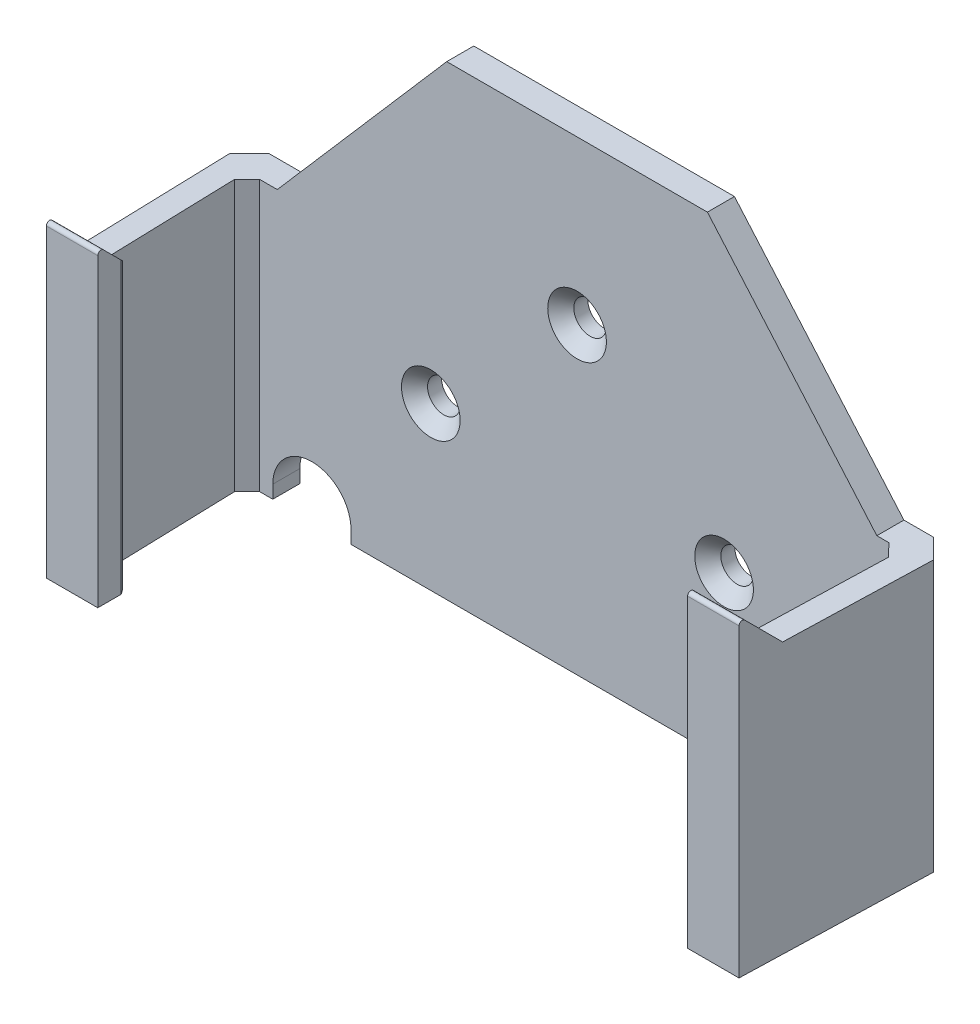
ISO-10303-21;
HEADER;
FILE_DESCRIPTION(('STEP AP214'),'2;1');
FILE_NAME('part.step','',(''),(''),'','','');
FILE_SCHEMA(('AUTOMOTIVE_DESIGN { 1 0 10303 214 1 1 1 1 }'));
ENDSEC;
DATA;
#1=APPLICATION_CONTEXT('core data for automotive mechanical design processes');
#2=APPLICATION_PROTOCOL_DEFINITION('international standard','automotive_design',2000,#1);
#3=PRODUCT_CONTEXT('',#1,'mechanical');
#4=PRODUCT('Part','Part','',(#3));
#5=PRODUCT_RELATED_PRODUCT_CATEGORY('part','',(#4));
#6=PRODUCT_DEFINITION_FORMATION('','',#4);
#7=PRODUCT_DEFINITION_CONTEXT('part definition',#1,'design');
#8=PRODUCT_DEFINITION('design','',#6,#7);
#9=PRODUCT_DEFINITION_SHAPE('','',#8);
#10=(LENGTH_UNIT() NAMED_UNIT(*) SI_UNIT(.MILLI.,.METRE.));
#11=(NAMED_UNIT(*) PLANE_ANGLE_UNIT() SI_UNIT($,.RADIAN.));
#12=(NAMED_UNIT(*) SI_UNIT($,.STERADIAN.) SOLID_ANGLE_UNIT());
#13=UNCERTAINTY_MEASURE_WITH_UNIT(LENGTH_MEASURE(1.E-05),#10,'distance_accuracy_value','');
#14=(GEOMETRIC_REPRESENTATION_CONTEXT(3) GLOBAL_UNCERTAINTY_ASSIGNED_CONTEXT((#13)) GLOBAL_UNIT_ASSIGNED_CONTEXT((#10,
#11,#12)) REPRESENTATION_CONTEXT('',''));
#15=CARTESIAN_POINT('',(0.,0.,0.));
#16=DIRECTION('',(0.,0.,1.));
#17=DIRECTION('',(1.,0.,0.));
#18=AXIS2_PLACEMENT_3D('',#15,#16,#17);
#19=CARTESIAN_POINT('',(116.,41.5,25.5));
#20=DIRECTION('',(0.,-1.,0.));
#21=DIRECTION('',(0.,0.,-1.));
#22=AXIS2_PLACEMENT_3D('',#19,#20,#21);
#23=PLANE('',#22);
#24=DIRECTION('',(-1.,0.,0.));
#25=VECTOR('',#24,1.);
#26=CARTESIAN_POINT('',(116.,41.5,0.));
#27=LINE('',#26,#25);
#28=CARTESIAN_POINT('',(105.,41.5,0.));
#29=VERTEX_POINT('',#28);
#30=CARTESIAN_POINT('',(100.440578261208,41.5,0.));
#31=VERTEX_POINT('',#30);
#32=EDGE_CURVE('E308',#29,#31,#27,.T.);
#33=ORIENTED_EDGE('',*,*,#32,.T.);
#34=DIRECTION('',(0.,0.,-1.));
#35=VECTOR('',#34,1.);
#36=CARTESIAN_POINT('',(100.440578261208,41.5,100.917662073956));
#37=LINE('',#36,#35);
#38=CARTESIAN_POINT('',(100.440578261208,41.5,4.14989884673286));
#39=VERTEX_POINT('',#38);
#40=EDGE_CURVE('E601',#39,#31,#37,.T.);
#41=ORIENTED_EDGE('',*,*,#40,.F.);
#42=DIRECTION('',(-1.,0.,0.));
#43=VECTOR('',#42,1.);
#44=CARTESIAN_POINT('',(104.25,41.5,4.14989884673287));
#45=LINE('',#44,#43);
#46=CARTESIAN_POINT('',(102.30687413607,41.5,4.14989884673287));
#47=VERTEX_POINT('',#46);
#48=EDGE_CURVE('E323',#47,#39,#45,.T.);
#49=ORIENTED_EDGE('',*,*,#48,.F.);
#50=DIRECTION('',(0.685785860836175,0.,0.727803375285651));
#51=VECTOR('',#50,1.);
#52=CARTESIAN_POINT('',(119.402986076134,41.5,22.2934749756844));
#53=LINE('',#52,#51);
#54=CARTESIAN_POINT('',(104.190578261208,41.5,6.14901591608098));
#55=VERTEX_POINT('',#54);
#56=EDGE_CURVE('E491',#47,#55,#53,.T.);
#57=ORIENTED_EDGE('',*,*,#56,.T.);
#58=DIRECTION('',(-0.0297108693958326,0.,0.999558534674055));
#59=VECTOR('',#58,1.);
#60=CARTESIAN_POINT('',(104.25,41.5,4.14989884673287));
#61=LINE('',#60,#59);
#62=CARTESIAN_POINT('',(103.615389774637,41.5,25.5));
#63=VERTEX_POINT('',#62);
#64=EDGE_CURVE('E320',#55,#63,#61,.T.);
#65=ORIENTED_EDGE('',*,*,#64,.T.);
#66=DIRECTION('',(-1.,0.,0.));
#67=VECTOR('',#66,1.);
#68=CARTESIAN_POINT('',(116.,41.5,25.5));
#69=LINE('',#68,#67);
#70=CARTESIAN_POINT('',(107.331210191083,41.5,25.5));
#71=VERTEX_POINT('',#70);
#72=EDGE_CURVE('E321',#71,#63,#69,.T.);
#73=ORIENTED_EDGE('',*,*,#72,.F.);
#74=DIRECTION('',(0.0297108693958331,0.,-0.999558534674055));
#75=VECTOR('',#74,1.);
#76=CARTESIAN_POINT('',(107.338862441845,41.5,25.2425564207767));
#77=LINE('',#76,#75);
#78=CARTESIAN_POINT('',(108.,41.5,3.));
#79=VERTEX_POINT('',#78);
#80=EDGE_CURVE('E314',#71,#79,#77,.T.);
#81=ORIENTED_EDGE('',*,*,#80,.T.);
#82=DIRECTION('',(-0.707106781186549,0.,-0.707106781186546));
#83=VECTOR('',#82,1.);
#84=CARTESIAN_POINT('',(108.,41.5,2.99999999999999));
#85=LINE('',#84,#83);
#86=EDGE_CURVE('E318',#79,#29,#85,.T.);
#87=ORIENTED_EDGE('',*,*,#86,.T.);
#88=EDGE_LOOP('',(#33,#41,#49,#57,#65,#73,#81,#87));
#89=FACE_BOUND('',#88,.T.);
#90=ADVANCED_FACE('F47',(#89),#23,.F.);
#91=CARTESIAN_POINT('',(0.,0.,32.));
#92=DIRECTION('',(0.,1.,0.));
#93=DIRECTION('',(-1.,0.,0.));
#94=AXIS2_PLACEMENT_3D('',#91,#92,#93);
#95=PLANE('',#94);
#96=DIRECTION('',(1.,0.,0.));
#97=VECTOR('',#96,1.);
#98=CARTESIAN_POINT('',(0.,0.,0.));
#99=LINE('',#98,#97);
#100=CARTESIAN_POINT('',(3.,0.,0.));
#101=VERTEX_POINT('',#100);
#102=CARTESIAN_POINT('',(7.75000000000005,0.,0.));
#103=VERTEX_POINT('',#102);
#104=EDGE_CURVE('E389',#101,#103,#99,.T.);
#105=ORIENTED_EDGE('',*,*,#104,.T.);
#106=DIRECTION('',(0.,0.,-1.));
#107=VECTOR('',#106,1.);
#108=CARTESIAN_POINT('',(7.75000000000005,0.,4.25));
#109=LINE('',#108,#107);
#110=CARTESIAN_POINT('',(7.75000000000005,0.,4.14989884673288));
#111=VERTEX_POINT('',#110);
#112=EDGE_CURVE('E681',#111,#103,#109,.T.);
#113=ORIENTED_EDGE('',*,*,#112,.F.);
#114=DIRECTION('',(-1.,0.,0.));
#115=VECTOR('',#114,1.);
#116=CARTESIAN_POINT('',(0.,0.,4.14989884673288));
#117=LINE('',#116,#115);
#118=CARTESIAN_POINT('',(5.75000000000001,0.,4.14989884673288));
#119=VERTEX_POINT('',#118);
#120=EDGE_CURVE('E367',#111,#119,#117,.T.);
#121=ORIENTED_EDGE('',*,*,#120,.T.);
#122=DIRECTION('',(0.707106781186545,0.,-0.70710678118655));
#123=VECTOR('',#122,1.);
#124=CARTESIAN_POINT('',(-11.0500505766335,0.,20.9499494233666));
#125=LINE('',#124,#123);
#126=CARTESIAN_POINT('',(3.80773195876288,0.,6.09216688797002));
#127=VERTEX_POINT('',#126);
#128=EDGE_CURVE('E496',#119,#127,#125,.F.);
#129=ORIENTED_EDGE('',*,*,#128,.T.);
#130=DIRECTION('',(0.0297108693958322,0.,0.999558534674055));
#131=VECTOR('',#130,1.);
#132=CARTESIAN_POINT('',(4.57377516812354,0.,31.8640491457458));
#133=LINE('',#132,#131);
#134=CARTESIAN_POINT('',(4.44423182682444,0.,27.505841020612));
#135=VERTEX_POINT('',#134);
#136=EDGE_CURVE('E370',#127,#135,#133,.T.);
#137=ORIENTED_EDGE('',*,*,#136,.T.);
#138=CARTESIAN_POINT('',(4.64414353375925,0.,27.4998988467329));
#139=DIRECTION('',(0.,1.,0.));
#140=DIRECTION('',(-1.,0.,0.));
#141=AXIS2_PLACEMENT_3D('',#138,#139,#140);
#142=CIRCLE('',#141,0.2);
#143=CARTESIAN_POINT('',(4.64414353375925,0.,27.6998988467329));
#144=VERTEX_POINT('',#143);
#145=EDGE_CURVE('E480',#135,#144,#142,.T.);
#146=ORIENTED_EDGE('',*,*,#145,.T.);
#147=DIRECTION('',(-1.,0.,0.));
#148=VECTOR('',#147,1.);
#149=CARTESIAN_POINT('',(0.,0.,27.6998988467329));
#150=LINE('',#149,#148);
#151=CARTESIAN_POINT('',(8.25000000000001,0.,27.6998988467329));
#152=VERTEX_POINT('',#151);
#153=EDGE_CURVE('E373',#152,#144,#150,.T.);
#154=ORIENTED_EDGE('',*,*,#153,.F.);
#155=DIRECTION('',(0.567371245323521,0.,0.823462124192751));
#156=VECTOR('',#155,1.);
#157=CARTESIAN_POINT('',(7.60328622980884,0.,26.7612818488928));
#158=LINE('',#157,#156);
#159=CARTESIAN_POINT('',(8.75000000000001,0.,28.4255807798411));
#160=VERTEX_POINT('',#159);
#161=EDGE_CURVE('E376',#152,#160,#158,.T.);
#162=ORIENTED_EDGE('',*,*,#161,.T.);
#163=DIRECTION('',(0.,0.,-1.));
#164=VECTOR('',#163,1.);
#165=CARTESIAN_POINT('',(8.75000000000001,0.,32.));
#166=LINE('',#165,#164);
#167=CARTESIAN_POINT('',(8.75000000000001,0.,32.));
#168=VERTEX_POINT('',#167);
#169=EDGE_CURVE('E352',#168,#160,#166,.T.);
#170=ORIENTED_EDGE('',*,*,#169,.F.);
#171=DIRECTION('',(1.,0.,0.));
#172=VECTOR('',#171,1.);
#173=CARTESIAN_POINT('',(0.,0.,32.));
#174=LINE('',#173,#172);
#175=CARTESIAN_POINT('',(0.861995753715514,0.,32.));
#176=VERTEX_POINT('',#175);
#177=EDGE_CURVE('E385',#176,#168,#174,.T.);
#178=ORIENTED_EDGE('',*,*,#177,.F.);
#179=DIRECTION('',(-0.0297108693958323,0.,-0.999558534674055));
#180=VECTOR('',#179,1.);
#181=CARTESIAN_POINT('',(0.86123483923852,0.,31.9744006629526));
#182=LINE('',#181,#180);
#183=CARTESIAN_POINT('',(0.,0.,3.00000000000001));
#184=VERTEX_POINT('',#183);
#185=EDGE_CURVE('E638',#176,#184,#182,.T.);
#186=ORIENTED_EDGE('',*,*,#185,.T.);
#187=DIRECTION('',(0.707106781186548,0.,-0.707106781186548));
#188=VECTOR('',#187,1.);
#189=CARTESIAN_POINT('',(0.,0.,3.));
#190=LINE('',#189,#188);
#191=EDGE_CURVE('E403',#184,#101,#190,.T.);
#192=ORIENTED_EDGE('',*,*,#191,.T.);
#193=EDGE_LOOP('',(#105,#113,#121,#129,#137,#146,#154,#162,#170,#178,#186,#192));
#194=FACE_BOUND('',#193,.T.);
#195=ADVANCED_FACE('F511',(#194),#95,.F.);
#196=CARTESIAN_POINT('',(88.7500000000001,0.,4.14989884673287));
#197=VERTEX_POINT('',#196);
#198=CARTESIAN_POINT('',(19.7500000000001,0.,4.14989884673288));
#199=VERTEX_POINT('',#198);
#200=EDGE_CURVE('E371',#197,#199,#117,.T.);
#201=ORIENTED_EDGE('',*,*,#200,.T.);
#202=DIRECTION('',(0.,0.,-1.));
#203=VECTOR('',#202,1.);
#204=CARTESIAN_POINT('',(19.7500000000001,0.,4.25));
#205=LINE('',#204,#203);
#206=CARTESIAN_POINT('',(19.7500000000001,0.,0.));
#207=VERTEX_POINT('',#206);
#208=EDGE_CURVE('E683',#199,#207,#205,.T.);
#209=ORIENTED_EDGE('',*,*,#208,.T.);
#210=CARTESIAN_POINT('',(88.7500000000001,0.,0.));
#211=VERTEX_POINT('',#210);
#212=EDGE_CURVE('E392',#207,#211,#99,.T.);
#213=ORIENTED_EDGE('',*,*,#212,.T.);
#214=DIRECTION('',(0.,0.,-1.));
#215=VECTOR('',#214,1.);
#216=CARTESIAN_POINT('',(88.7500000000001,0.,4.25));
#217=LINE('',#216,#215);
#218=EDGE_CURVE('E693',#197,#211,#217,.T.);
#219=ORIENTED_EDGE('',*,*,#218,.F.);
#220=EDGE_LOOP('',(#201,#209,#213,#219));
#221=FACE_BOUND('',#220,.T.);
#222=ADVANCED_FACE('F517',(#221),#95,.F.);
#223=CARTESIAN_POINT('',(0.,0.,32.));
#224=DIRECTION('',(0.,0.,-1.));
#225=DIRECTION('',(-1.,0.,0.));
#226=AXIS2_PLACEMENT_3D('',#223,#224,#225);
#227=PLANE('',#226);
#228=DIRECTION('',(-1.,0.,0.));
#229=VECTOR('',#228,1.);
#230=CARTESIAN_POINT('',(0.,46.7928932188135,32.));
#231=LINE('',#230,#229);
#232=CARTESIAN_POINT('',(8.75000000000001,46.7928932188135,32.));
#233=VERTEX_POINT('',#232);
#234=CARTESIAN_POINT('',(0.861995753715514,46.7928932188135,32.));
#235=VERTEX_POINT('',#234);
#236=EDGE_CURVE('E421',#233,#235,#231,.T.);
#237=ORIENTED_EDGE('',*,*,#236,.T.);
#238=DIRECTION('',(0.,1.,0.));
#239=VECTOR('',#238,1.);
#240=CARTESIAN_POINT('',(0.861995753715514,-8.49999999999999,32.));
#241=LINE('',#240,#239);
#242=EDGE_CURVE('E642',#176,#235,#241,.T.);
#243=ORIENTED_EDGE('',*,*,#242,.F.);
#244=ORIENTED_EDGE('',*,*,#177,.T.);
#245=DIRECTION('',(0.,-1.,0.));
#246=VECTOR('',#245,1.);
#247=CARTESIAN_POINT('',(8.75000000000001,0.,32.));
#248=LINE('',#247,#246);
#249=EDGE_CURVE('E387',#233,#168,#248,.T.);
#250=ORIENTED_EDGE('',*,*,#249,.F.);
#251=EDGE_LOOP('',(#237,#243,#244,#250));
#252=FACE_BOUND('',#251,.T.);
#253=ADVANCED_FACE('F760',(#252),#227,.F.);
#254=DIRECTION('',(-0.0297108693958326,0.,0.999558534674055));
#255=VECTOR('',#254,1.);
#256=CARTESIAN_POINT('',(103.330889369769,0.,35.0714064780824));
#257=LINE('',#256,#255);
#258=CARTESIAN_POINT('',(104.190578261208,0.,6.14901591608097));
#259=VERTEX_POINT('',#258);
#260=CARTESIAN_POINT('',(103.555768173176,0.,27.505841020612));
#261=VERTEX_POINT('',#260);
#262=EDGE_CURVE('E365',#259,#261,#257,.T.);
#263=ORIENTED_EDGE('',*,*,#262,.F.);
#264=DIRECTION('',(-0.685785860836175,0.,-0.727803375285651));
#265=VECTOR('',#264,1.);
#266=CARTESIAN_POINT('',(68.0921876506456,0.,-32.1610922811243));
#267=LINE('',#266,#265);
#268=CARTESIAN_POINT('',(102.30687413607,0.,4.14989884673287));
#269=VERTEX_POINT('',#268);
#270=EDGE_CURVE('E493',#259,#269,#267,.T.);
#271=ORIENTED_EDGE('',*,*,#270,.T.);
#272=CARTESIAN_POINT('',(100.75,0.,4.14989884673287));
#273=VERTEX_POINT('',#272);
#274=EDGE_CURVE('E368',#269,#273,#117,.T.);
#275=ORIENTED_EDGE('',*,*,#274,.T.);
#276=DIRECTION('',(0.,0.,-1.));
#277=VECTOR('',#276,1.);
#278=CARTESIAN_POINT('',(100.75,0.,4.25));
#279=LINE('',#278,#277);
#280=CARTESIAN_POINT('',(100.75,0.,0.));
#281=VERTEX_POINT('',#280);
#282=EDGE_CURVE('E690',#273,#281,#279,.T.);
#283=ORIENTED_EDGE('',*,*,#282,.T.);
#284=CARTESIAN_POINT('',(105.,0.,0.));
#285=VERTEX_POINT('',#284);
#286=EDGE_CURVE('E384',#281,#285,#99,.T.);
#287=ORIENTED_EDGE('',*,*,#286,.T.);
#288=DIRECTION('',(0.707106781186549,0.,0.707106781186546));
#289=VECTOR('',#288,1.);
#290=CARTESIAN_POINT('',(108.,0.,2.99999999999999));
#291=LINE('',#290,#289);
#292=CARTESIAN_POINT('',(108.,0.,3.00000000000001));
#293=VERTEX_POINT('',#292);
#294=EDGE_CURVE('E405',#285,#293,#291,.T.);
#295=ORIENTED_EDGE('',*,*,#294,.T.);
#296=DIRECTION('',(-0.0297108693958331,0.,0.999558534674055));
#297=VECTOR('',#296,1.);
#298=CARTESIAN_POINT('',(107.043429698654,0.,35.1817579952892));
#299=LINE('',#298,#297);
#300=CARTESIAN_POINT('',(107.138004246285,0.,32.));
#301=VERTEX_POINT('',#300);
#302=EDGE_CURVE('E309',#293,#301,#299,.T.);
#303=ORIENTED_EDGE('',*,*,#302,.T.);
#304=CARTESIAN_POINT('',(99.25,0.,32.));
#305=VERTEX_POINT('',#304);
#306=EDGE_CURVE('E388',#305,#301,#174,.T.);
#307=ORIENTED_EDGE('',*,*,#306,.F.);
#308=DIRECTION('',(0.,0.,-1.));
#309=VECTOR('',#308,1.);
#310=CARTESIAN_POINT('',(99.25,0.,32.));
#311=LINE('',#310,#309);
#312=CARTESIAN_POINT('',(99.25,0.,28.425580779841));
#313=VERTEX_POINT('',#312);
#314=EDGE_CURVE('E362',#305,#313,#311,.T.);
#315=ORIENTED_EDGE('',*,*,#314,.T.);
#316=DIRECTION('',(-0.56737124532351,0.,0.823462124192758));
#317=VECTOR('',#316,1.);
#318=CARTESIAN_POINT('',(65.6304197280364,0.,77.2198247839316));
#319=LINE('',#318,#317);
#320=CARTESIAN_POINT('',(99.75,0.,27.6998988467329));
#321=VERTEX_POINT('',#320);
#322=EDGE_CURVE('E379',#321,#313,#319,.T.);
#323=ORIENTED_EDGE('',*,*,#322,.F.);
#324=DIRECTION('',(1.,0.,0.));
#325=VECTOR('',#324,1.);
#326=CARTESIAN_POINT('',(0.,0.,27.6998988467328));
#327=LINE('',#326,#325);
#328=CARTESIAN_POINT('',(103.355856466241,0.,27.6998988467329));
#329=VERTEX_POINT('',#328);
#330=EDGE_CURVE('E381',#321,#329,#327,.T.);
#331=ORIENTED_EDGE('',*,*,#330,.T.);
#332=CARTESIAN_POINT('',(103.355856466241,0.,27.4998988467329));
#333=DIRECTION('',(0.,1.,0.));
#334=DIRECTION('',(-1.,0.,0.));
#335=AXIS2_PLACEMENT_3D('',#332,#333,#334);
#336=CIRCLE('',#335,0.2);
#337=EDGE_CURVE('E475',#329,#261,#336,.T.);
#338=ORIENTED_EDGE('',*,*,#337,.T.);
#339=EDGE_LOOP('',(#263,#271,#275,#283,#287,#295,#303,#307,#315,#323,#331,#338));
#340=FACE_BOUND('',#339,.T.);
#341=ADVANCED_FACE('F520',(#340),#95,.F.);
#342=ORIENTED_EDGE('',*,*,#306,.T.);
#343=DIRECTION('',(0.,1.,0.));
#344=VECTOR('',#343,1.);
#345=CARTESIAN_POINT('',(107.138004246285,-8.49999999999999,32.));
#346=LINE('',#345,#344);
#347=CARTESIAN_POINT('',(107.138004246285,46.7928932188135,32.));
#348=VERTEX_POINT('',#347);
#349=EDGE_CURVE('E680',#301,#348,#346,.T.);
#350=ORIENTED_EDGE('',*,*,#349,.T.);
#351=DIRECTION('',(-1.,0.,0.));
#352=VECTOR('',#351,1.);
#353=CARTESIAN_POINT('',(0.,46.7928932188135,32.));
#354=LINE('',#353,#352);
#355=CARTESIAN_POINT('',(99.25,46.7928932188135,32.));
#356=VERTEX_POINT('',#355);
#357=EDGE_CURVE('E414',#348,#356,#354,.T.);
#358=ORIENTED_EDGE('',*,*,#357,.T.);
#359=DIRECTION('',(0.,-1.,0.));
#360=VECTOR('',#359,1.);
#361=CARTESIAN_POINT('',(99.25,0.,32.));
#362=LINE('',#361,#360);
#363=EDGE_CURVE('E395',#356,#305,#362,.T.);
#364=ORIENTED_EDGE('',*,*,#363,.T.);
#365=EDGE_LOOP('',(#342,#350,#358,#364));
#366=FACE_BOUND('',#365,.T.);
#367=ADVANCED_FACE('F706',(#366),#227,.F.);
#368=CARTESIAN_POINT('',(0.,0.,0.));
#369=DIRECTION('',(0.,0.,-1.));
#370=DIRECTION('',(-1.,0.,0.));
#371=AXIS2_PLACEMENT_3D('',#368,#369,#370);
#372=PLANE('',#371);
#373=CARTESIAN_POINT('',(54.4405782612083,46.5,0.));
#374=DIRECTION('',(0.,0.,-1.));
#375=DIRECTION('',(-1.,0.,0.));
#376=AXIS2_PLACEMENT_3D('',#373,#374,#375);
#377=CIRCLE('',#376,2.5);
#378=CARTESIAN_POINT('',(51.9405782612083,46.5,0.));
#379=VERTEX_POINT('',#378);
#380=EDGE_CURVE('E291',#379,#379,#377,.T.);
#381=ORIENTED_EDGE('',*,*,#380,.F.);
#382=EDGE_LOOP('',(#381));
#383=FACE_BOUND('',#382,.T.);
#384=CARTESIAN_POINT('',(77.,24.8351380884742,0.));
#385=DIRECTION('',(0.,0.,-1.));
#386=DIRECTION('',(-1.,0.,0.));
#387=AXIS2_PLACEMENT_3D('',#384,#385,#386);
#388=CIRCLE('',#387,2.50000000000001);
#389=CARTESIAN_POINT('',(74.5,24.8351380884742,0.));
#390=VERTEX_POINT('',#389);
#391=EDGE_CURVE('E662',#390,#390,#388,.T.);
#392=ORIENTED_EDGE('',*,*,#391,.F.);
#393=EDGE_LOOP('',(#392));
#394=FACE_BOUND('',#393,.T.);
#395=CARTESIAN_POINT('',(32.,24.8351380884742,0.));
#396=DIRECTION('',(0.,0.,-1.));
#397=DIRECTION('',(-1.,0.,0.));
#398=AXIS2_PLACEMENT_3D('',#395,#396,#397);
#399=CIRCLE('',#398,2.49999999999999);
#400=CARTESIAN_POINT('',(29.5,24.8351380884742,0.));
#401=VERTEX_POINT('',#400);
#402=EDGE_CURVE('E661',#401,#401,#399,.T.);
#403=ORIENTED_EDGE('',*,*,#402,.F.);
#404=EDGE_LOOP('',(#403));
#405=FACE_BOUND('',#404,.T.);
#406=DIRECTION('',(0.,1.,0.));
#407=VECTOR('',#406,1.);
#408=CARTESIAN_POINT('',(7.75000000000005,2.,0.));
#409=LINE('',#408,#407);
#410=CARTESIAN_POINT('',(7.75000000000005,2.,0.));
#411=VERTEX_POINT('',#410);
#412=EDGE_CURVE('E674',#103,#411,#409,.T.);
#413=ORIENTED_EDGE('',*,*,#412,.F.);
#414=ORIENTED_EDGE('',*,*,#104,.F.);
#415=DIRECTION('',(0.,1.,0.));
#416=VECTOR('',#415,1.);
#417=CARTESIAN_POINT('',(3.,48.,0.));
#418=LINE('',#417,#416);
#419=CARTESIAN_POINT('',(3.,41.5,0.));
#420=VERTEX_POINT('',#419);
#421=EDGE_CURVE('E307',#101,#420,#418,.T.);
#422=ORIENTED_EDGE('',*,*,#421,.T.);
#423=CARTESIAN_POINT('',(8.44057826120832,41.5,0.));
#424=VERTEX_POINT('',#423);
#425=EDGE_CURVE('E297',#424,#420,#27,.T.);
#426=ORIENTED_EDGE('',*,*,#425,.F.);
#427=DIRECTION('',(0.654930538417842,0.755689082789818,0.));
#428=VECTOR('',#427,1.);
#429=CARTESIAN_POINT('',(34.4405782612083,71.5,0.));
#430=LINE('',#429,#428);
#431=CARTESIAN_POINT('',(34.4405782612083,71.5,0.));
#432=VERTEX_POINT('',#431);
#433=EDGE_CURVE('E282',#424,#432,#430,.T.);
#434=ORIENTED_EDGE('',*,*,#433,.T.);
#435=DIRECTION('',(1.,0.,0.));
#436=VECTOR('',#435,1.);
#437=CARTESIAN_POINT('',(74.4405782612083,71.5,0.));
#438=LINE('',#437,#436);
#439=CARTESIAN_POINT('',(74.4405782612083,71.5,0.));
#440=VERTEX_POINT('',#439);
#441=EDGE_CURVE('E290',#432,#440,#438,.T.);
#442=ORIENTED_EDGE('',*,*,#441,.T.);
#443=DIRECTION('',(0.654930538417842,-0.755689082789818,0.));
#444=VECTOR('',#443,1.);
#445=CARTESIAN_POINT('',(100.440578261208,41.5,0.));
#446=LINE('',#445,#444);
#447=EDGE_CURVE('E300',#440,#31,#446,.T.);
#448=ORIENTED_EDGE('',*,*,#447,.T.);
#449=ORIENTED_EDGE('',*,*,#32,.F.);
#450=DIRECTION('',(0.,-1.,0.));
#451=VECTOR('',#450,1.);
#452=CARTESIAN_POINT('',(105.,0.,0.));
#453=LINE('',#452,#451);
#454=EDGE_CURVE('E400',#29,#285,#453,.T.);
#455=ORIENTED_EDGE('',*,*,#454,.T.);
#456=ORIENTED_EDGE('',*,*,#286,.F.);
#457=DIRECTION('',(0.,-1.,0.));
#458=VECTOR('',#457,1.);
#459=CARTESIAN_POINT('',(100.75,1.99999999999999,0.));
#460=LINE('',#459,#458);
#461=CARTESIAN_POINT('',(100.75,1.99999999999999,0.));
#462=VERTEX_POINT('',#461);
#463=EDGE_CURVE('E698',#462,#281,#460,.T.);
#464=ORIENTED_EDGE('',*,*,#463,.F.);
#465=CARTESIAN_POINT('',(94.7500000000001,2.,0.));
#466=DIRECTION('',(0.,0.,-1.));
#467=DIRECTION('',(-1.,0.,0.));
#468=AXIS2_PLACEMENT_3D('',#465,#466,#467);
#469=CIRCLE('',#468,5.99999999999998);
#470=CARTESIAN_POINT('',(88.7500000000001,2.,0.));
#471=VERTEX_POINT('',#470);
#472=EDGE_CURVE('E672',#471,#462,#469,.T.);
#473=ORIENTED_EDGE('',*,*,#472,.F.);
#474=DIRECTION('',(0.,1.,0.));
#475=VECTOR('',#474,1.);
#476=CARTESIAN_POINT('',(88.7500000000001,2.,0.));
#477=LINE('',#476,#475);
#478=EDGE_CURVE('E689',#211,#471,#477,.T.);
#479=ORIENTED_EDGE('',*,*,#478,.F.);
#480=ORIENTED_EDGE('',*,*,#212,.F.);
#481=DIRECTION('',(0.,-1.,0.));
#482=VECTOR('',#481,1.);
#483=CARTESIAN_POINT('',(19.7500000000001,2.,0.));
#484=LINE('',#483,#482);
#485=CARTESIAN_POINT('',(19.7500000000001,2.,0.));
#486=VERTEX_POINT('',#485);
#487=EDGE_CURVE('E671',#486,#207,#484,.T.);
#488=ORIENTED_EDGE('',*,*,#487,.F.);
#489=CARTESIAN_POINT('',(13.7500000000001,2.,0.));
#490=DIRECTION('',(0.,0.,-1.));
#491=DIRECTION('',(1.,0.,0.));
#492=AXIS2_PLACEMENT_3D('',#489,#490,#491);
#493=CIRCLE('',#492,6.00000000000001);
#494=EDGE_CURVE('E668',#411,#486,#493,.T.);
#495=ORIENTED_EDGE('',*,*,#494,.F.);
#496=EDGE_LOOP('',(#413,#414,#422,#426,#434,#442,#448,#449,#455,#456,#464,#473,#479,#480,#488,#495));
#497=FACE_BOUND('',#496,.T.);
#498=ADVANCED_FACE('F304',(#383,#394,#405,#497),#372,.T.);
#499=CARTESIAN_POINT('',(99.75,-71.,27.6998988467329));
#500=DIRECTION('',(0.,0.,1.));
#501=DIRECTION('',(1.,0.,0.));
#502=AXIS2_PLACEMENT_3D('',#499,#500,#501);
#503=PLANE('',#502);
#504=DIRECTION('',(1.,0.,0.));
#505=VECTOR('',#504,1.);
#506=CARTESIAN_POINT('',(99.7499999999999,43.6998988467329,27.6998988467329));
#507=LINE('',#506,#505);
#508=CARTESIAN_POINT('',(99.75,43.6998988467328,27.6998988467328));
#509=VERTEX_POINT('',#508);
#510=CARTESIAN_POINT('',(103.355856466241,43.6998988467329,27.6998988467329));
#511=VERTEX_POINT('',#510);
#512=EDGE_CURVE('E342',#509,#511,#507,.T.);
#513=ORIENTED_EDGE('',*,*,#512,.T.);
#514=DIRECTION('',(0.,1.,0.));
#515=VECTOR('',#514,1.);
#516=CARTESIAN_POINT('',(103.355856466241,-71.,27.6998988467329));
#517=LINE('',#516,#515);
#518=EDGE_CURVE('E465',#511,#329,#517,.F.);
#519=ORIENTED_EDGE('',*,*,#518,.T.);
#520=ORIENTED_EDGE('',*,*,#330,.F.);
#521=DIRECTION('',(0.,1.,0.));
#522=VECTOR('',#521,1.);
#523=CARTESIAN_POINT('',(99.75,-71.,27.6998988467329));
#524=LINE('',#523,#522);
#525=EDGE_CURVE('E349',#321,#509,#524,.T.);
#526=ORIENTED_EDGE('',*,*,#525,.T.);
#527=EDGE_LOOP('',(#513,#519,#520,#526));
#528=FACE_BOUND('',#527,.T.);
#529=ADVANCED_FACE('F890',(#528),#503,.F.);
#530=CARTESIAN_POINT('',(99.75,-71.,27.6998988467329));
#531=DIRECTION('',(-0.823462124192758,0.,-0.56737124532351));
#532=DIRECTION('',(-0.56737124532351,0.,0.823462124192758));
#533=AXIS2_PLACEMENT_3D('',#530,#531,#532);
#534=PLANE('',#533);
#535=DIRECTION('',(-0.437985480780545,0.635676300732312,0.635676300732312));
#536=VECTOR('',#535,1.);
#537=CARTESIAN_POINT('',(131.684400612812,-2.64853629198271,-18.6485362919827));
#538=LINE('',#537,#536);
#539=CARTESIAN_POINT('',(99.25,44.425580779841,28.425580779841));
#540=VERTEX_POINT('',#539);
#541=EDGE_CURVE('E339',#509,#540,#538,.T.);
#542=ORIENTED_EDGE('',*,*,#541,.F.);
#543=ORIENTED_EDGE('',*,*,#525,.F.);
#544=ORIENTED_EDGE('',*,*,#322,.T.);
#545=DIRECTION('',(0.,1.,0.));
#546=VECTOR('',#545,1.);
#547=CARTESIAN_POINT('',(99.25,-71.,28.425580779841));
#548=LINE('',#547,#546);
#549=EDGE_CURVE('E353',#313,#540,#548,.T.);
#550=ORIENTED_EDGE('',*,*,#549,.T.);
#551=EDGE_LOOP('',(#542,#543,#544,#550));
#552=FACE_BOUND('',#551,.T.);
#553=ADVANCED_FACE('F1163',(#552),#534,.T.);
#554=CARTESIAN_POINT('',(8.25000000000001,-71.,27.6998988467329));
#555=DIRECTION('',(-0.823462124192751,0.,0.567371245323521));
#556=DIRECTION('',(0.567371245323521,0.,0.823462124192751));
#557=AXIS2_PLACEMENT_3D('',#554,#555,#556);
#558=PLANE('',#557);
#559=DIRECTION('',(0.,1.,0.));
#560=VECTOR('',#559,1.);
#561=CARTESIAN_POINT('',(8.25000000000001,-71.,27.6998988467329));
#562=LINE('',#561,#560);
#563=CARTESIAN_POINT('',(8.25000000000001,43.6998988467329,27.6998988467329));
#564=VERTEX_POINT('',#563);
#565=EDGE_CURVE('E348',#152,#564,#562,.T.);
#566=ORIENTED_EDGE('',*,*,#565,.T.);
#567=DIRECTION('',(0.437985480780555,0.635676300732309,0.635676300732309));
#568=VECTOR('',#567,1.);
#569=CARTESIAN_POINT('',(-23.6844006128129,-2.6485362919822,-18.6485362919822));
#570=LINE('',#569,#568);
#571=CARTESIAN_POINT('',(8.75000000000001,44.425580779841,28.4255807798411));
#572=VERTEX_POINT('',#571);
#573=EDGE_CURVE('E328',#564,#572,#570,.T.);
#574=ORIENTED_EDGE('',*,*,#573,.T.);
#575=DIRECTION('',(0.,1.,0.));
#576=VECTOR('',#575,1.);
#577=CARTESIAN_POINT('',(8.75000000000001,-71.,28.4255807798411));
#578=LINE('',#577,#576);
#579=EDGE_CURVE('E356',#160,#572,#578,.T.);
#580=ORIENTED_EDGE('',*,*,#579,.F.);
#581=ORIENTED_EDGE('',*,*,#161,.F.);
#582=EDGE_LOOP('',(#566,#574,#580,#581));
#583=FACE_BOUND('',#582,.T.);
#584=ADVANCED_FACE('F749',(#583),#558,.F.);
#585=CARTESIAN_POINT('',(8.25000000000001,-71.,27.6998988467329));
#586=DIRECTION('',(0.,0.,-1.));
#587=DIRECTION('',(-1.,0.,0.));
#588=AXIS2_PLACEMENT_3D('',#585,#586,#587);
#589=PLANE('',#588);
#590=ORIENTED_EDGE('',*,*,#153,.T.);
#591=DIRECTION('',(0.,1.,0.));
#592=VECTOR('',#591,1.);
#593=CARTESIAN_POINT('',(4.64414353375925,-71.,27.6998988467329));
#594=LINE('',#593,#592);
#595=CARTESIAN_POINT('',(4.64414353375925,43.6998988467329,27.6998988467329));
#596=VERTEX_POINT('',#595);
#597=EDGE_CURVE('E467',#144,#596,#594,.T.);
#598=ORIENTED_EDGE('',*,*,#597,.T.);
#599=DIRECTION('',(-1.,0.,0.));
#600=VECTOR('',#599,1.);
#601=CARTESIAN_POINT('',(8.25000000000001,43.6998988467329,27.6998988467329));
#602=LINE('',#601,#600);
#603=EDGE_CURVE('E331',#564,#596,#602,.T.);
#604=ORIENTED_EDGE('',*,*,#603,.F.);
#605=ORIENTED_EDGE('',*,*,#565,.F.);
#606=EDGE_LOOP('',(#590,#598,#604,#605));
#607=FACE_BOUND('',#606,.T.);
#608=ADVANCED_FACE('F745',(#607),#589,.T.);
#609=CARTESIAN_POINT('',(3.75,-71.,4.14989884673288));
#610=DIRECTION('',(-0.999558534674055,0.,0.0297108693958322));
#611=DIRECTION('',(0.0297108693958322,0.,0.999558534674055));
#612=AXIS2_PLACEMENT_3D('',#609,#610,#611);
#613=PLANE('',#612);
#614=ORIENTED_EDGE('',*,*,#136,.F.);
#615=DIRECTION('',(0.,1.,0.));
#616=VECTOR('',#615,1.);
#617=CARTESIAN_POINT('',(3.80773195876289,41.5,6.09216688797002));
#618=LINE('',#617,#616);
#619=CARTESIAN_POINT('',(3.80773195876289,41.5,6.09216688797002));
#620=VERTEX_POINT('',#619);
#621=EDGE_CURVE('E489',#127,#620,#618,.T.);
#622=ORIENTED_EDGE('',*,*,#621,.T.);
#623=DIRECTION('',(0.0297108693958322,0.,0.999558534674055));
#624=VECTOR('',#623,1.);
#625=CARTESIAN_POINT('',(3.75,41.5,4.14989884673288));
#626=LINE('',#625,#624);
#627=CARTESIAN_POINT('',(4.38461022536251,41.5,25.5));
#628=VERTEX_POINT('',#627);
#629=EDGE_CURVE('E326',#620,#628,#626,.T.);
#630=ORIENTED_EDGE('',*,*,#629,.T.);
#631=DIRECTION('',(0.0210133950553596,0.706950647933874,0.706950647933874));
#632=VECTOR('',#631,1.);
#633=CARTESIAN_POINT('',(2.39592876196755,-25.4049263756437,-41.4049263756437));
#634=LINE('',#633,#632);
#635=CARTESIAN_POINT('',(4.44423182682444,43.505841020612,27.505841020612));
#636=VERTEX_POINT('',#635);
#637=EDGE_CURVE('E334',#628,#636,#634,.T.);
#638=ORIENTED_EDGE('',*,*,#637,.T.);
#639=DIRECTION('',(0.,1.,0.));
#640=VECTOR('',#639,1.);
#641=CARTESIAN_POINT('',(4.44423182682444,-71.,27.505841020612));
#642=LINE('',#641,#640);
#643=EDGE_CURVE('E470',#636,#135,#642,.F.);
#644=ORIENTED_EDGE('',*,*,#643,.T.);
#645=EDGE_LOOP('',(#614,#622,#630,#638,#644));
#646=FACE_BOUND('',#645,.T.);
#647=ADVANCED_FACE('F737',(#646),#613,.F.);
#648=CARTESIAN_POINT('',(104.25,-71.,4.14989884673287));
#649=DIRECTION('',(0.,0.,-1.));
#650=DIRECTION('',(-1.,0.,0.));
#651=AXIS2_PLACEMENT_3D('',#648,#649,#650);
#652=PLANE('',#651);
#653=CARTESIAN_POINT('',(54.4405782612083,46.5,4.14989884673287));
#654=DIRECTION('',(0.,0.,-1.));
#655=DIRECTION('',(-1.,0.,0.));
#656=AXIS2_PLACEMENT_3D('',#653,#654,#655);
#657=CIRCLE('',#656,4.49999999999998);
#658=CARTESIAN_POINT('',(49.9405782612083,46.5,4.14989884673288));
#659=VERTEX_POINT('',#658);
#660=EDGE_CURVE('E11',#659,#659,#657,.T.);
#661=ORIENTED_EDGE('',*,*,#660,.T.);
#662=EDGE_LOOP('',(#661));
#663=FACE_BOUND('',#662,.T.);
#664=CARTESIAN_POINT('',(77.,24.8351380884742,4.14989884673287));
#665=DIRECTION('',(0.,0.,-1.));
#666=DIRECTION('',(-1.,0.,0.));
#667=AXIS2_PLACEMENT_3D('',#664,#665,#666);
#668=CIRCLE('',#667,4.50000000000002);
#669=CARTESIAN_POINT('',(72.5,24.8351380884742,4.14989884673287));
#670=VERTEX_POINT('',#669);
#671=EDGE_CURVE('E453',#670,#670,#668,.T.);
#672=ORIENTED_EDGE('',*,*,#671,.T.);
#673=EDGE_LOOP('',(#672));
#674=FACE_BOUND('',#673,.T.);
#675=CARTESIAN_POINT('',(32.,24.8351380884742,4.14989884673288));
#676=DIRECTION('',(0.,0.,-1.));
#677=DIRECTION('',(-1.,0.,0.));
#678=AXIS2_PLACEMENT_3D('',#675,#676,#677);
#679=CIRCLE('',#678,4.5);
#680=CARTESIAN_POINT('',(27.5,24.8351380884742,4.14989884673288));
#681=VERTEX_POINT('',#680);
#682=EDGE_CURVE('E450',#681,#681,#679,.T.);
#683=ORIENTED_EDGE('',*,*,#682,.T.);
#684=EDGE_LOOP('',(#683));
#685=FACE_BOUND('',#684,.T.);
#686=ORIENTED_EDGE('',*,*,#274,.F.);
#687=DIRECTION('',(0.,1.,0.));
#688=VECTOR('',#687,1.);
#689=CARTESIAN_POINT('',(102.30687413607,-71.,4.14989884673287));
#690=LINE('',#689,#688);
#691=EDGE_CURVE('E484',#269,#47,#690,.T.);
#692=ORIENTED_EDGE('',*,*,#691,.T.);
#693=ORIENTED_EDGE('',*,*,#48,.T.);
#694=DIRECTION('',(-0.654930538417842,0.755689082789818,0.));
#695=VECTOR('',#694,1.);
#696=CARTESIAN_POINT('',(100.440578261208,41.5,4.14989884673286));
#697=LINE('',#696,#695);
#698=CARTESIAN_POINT('',(74.4405782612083,71.5,4.14989884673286));
#699=VERTEX_POINT('',#698);
#700=EDGE_CURVE('E598',#39,#699,#697,.T.);
#701=ORIENTED_EDGE('',*,*,#700,.T.);
#702=DIRECTION('',(-1.,0.,0.));
#703=VECTOR('',#702,1.);
#704=CARTESIAN_POINT('',(74.4405782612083,71.5,4.14989884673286));
#705=LINE('',#704,#703);
#706=CARTESIAN_POINT('',(34.4405782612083,71.5,4.14989884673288));
#707=VERTEX_POINT('',#706);
#708=EDGE_CURVE('E607',#699,#707,#705,.T.);
#709=ORIENTED_EDGE('',*,*,#708,.T.);
#710=DIRECTION('',(-0.654930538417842,-0.755689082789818,0.));
#711=VECTOR('',#710,1.);
#712=CARTESIAN_POINT('',(34.4405782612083,71.5,4.14989884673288));
#713=LINE('',#712,#711);
#714=CARTESIAN_POINT('',(8.44057826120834,41.5,4.14989884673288));
#715=VERTEX_POINT('',#714);
#716=EDGE_CURVE('E606',#707,#715,#713,.T.);
#717=ORIENTED_EDGE('',*,*,#716,.T.);
#718=CARTESIAN_POINT('',(5.75000000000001,41.5,4.14989884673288));
#719=VERTEX_POINT('',#718);
#720=EDGE_CURVE('E299',#715,#719,#45,.T.);
#721=ORIENTED_EDGE('',*,*,#720,.T.);
#722=DIRECTION('',(0.,-1.,0.));
#723=VECTOR('',#722,1.);
#724=CARTESIAN_POINT('',(5.75000000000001,0.,4.14989884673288));
#725=LINE('',#724,#723);
#726=EDGE_CURVE('E482',#719,#119,#725,.T.);
#727=ORIENTED_EDGE('',*,*,#726,.T.);
#728=ORIENTED_EDGE('',*,*,#120,.F.);
#729=DIRECTION('',(0.,1.,0.));
#730=VECTOR('',#729,1.);
#731=CARTESIAN_POINT('',(7.75000000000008,-71.0000000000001,4.14989884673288));
#732=LINE('',#731,#730);
#733=CARTESIAN_POINT('',(7.75000000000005,2.,4.14989884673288));
#734=VERTEX_POINT('',#733);
#735=EDGE_CURVE('E447',#111,#734,#732,.T.);
#736=ORIENTED_EDGE('',*,*,#735,.T.);
#737=CARTESIAN_POINT('',(13.7500000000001,2.,4.14989884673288));
#738=DIRECTION('',(0.,0.,-1.));
#739=DIRECTION('',(-1.,0.,0.));
#740=AXIS2_PLACEMENT_3D('',#737,#738,#739);
#741=CIRCLE('',#740,6.00000000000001);
#742=CARTESIAN_POINT('',(19.7500000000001,2.,4.14989884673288));
#743=VERTEX_POINT('',#742);
#744=EDGE_CURVE('E444',#734,#743,#741,.T.);
#745=ORIENTED_EDGE('',*,*,#744,.T.);
#746=DIRECTION('',(0.,-1.,0.));
#747=VECTOR('',#746,1.);
#748=CARTESIAN_POINT('',(19.7500000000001,-71.,4.14989884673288));
#749=LINE('',#748,#747);
#750=EDGE_CURVE('E441',#743,#199,#749,.T.);
#751=ORIENTED_EDGE('',*,*,#750,.T.);
#752=ORIENTED_EDGE('',*,*,#200,.F.);
#753=DIRECTION('',(0.,1.,0.));
#754=VECTOR('',#753,1.);
#755=CARTESIAN_POINT('',(88.7499999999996,-70.9999999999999,4.14989884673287));
#756=LINE('',#755,#754);
#757=CARTESIAN_POINT('',(88.7500000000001,2.,4.14989884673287));
#758=VERTEX_POINT('',#757);
#759=EDGE_CURVE('E438',#197,#758,#756,.T.);
#760=ORIENTED_EDGE('',*,*,#759,.T.);
#761=CARTESIAN_POINT('',(94.7500000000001,2.,4.14989884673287));
#762=DIRECTION('',(0.,0.,-1.));
#763=DIRECTION('',(-1.,0.,0.));
#764=AXIS2_PLACEMENT_3D('',#761,#762,#763);
#765=CIRCLE('',#764,5.99999999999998);
#766=CARTESIAN_POINT('',(100.75,1.99999999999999,4.14989884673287));
#767=VERTEX_POINT('',#766);
#768=EDGE_CURVE('E435',#758,#767,#765,.T.);
#769=ORIENTED_EDGE('',*,*,#768,.T.);
#770=DIRECTION('',(0.,-1.,0.));
#771=VECTOR('',#770,1.);
#772=CARTESIAN_POINT('',(100.750000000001,-71.0000000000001,4.14989884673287));
#773=LINE('',#772,#771);
#774=EDGE_CURVE('E432',#767,#273,#773,.T.);
#775=ORIENTED_EDGE('',*,*,#774,.T.);
#776=EDGE_LOOP('',(#686,#692,#693,#701,#709,#717,#721,#727,#728,#736,#745,#751,#752,#760,#769,#775));
#777=FACE_BOUND('',#776,.T.);
#778=ADVANCED_FACE('F613',(#663,#674,#685,#777),#652,.F.);
#779=CARTESIAN_POINT('',(104.25,-71.,4.14989884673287));
#780=DIRECTION('',(-0.999558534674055,0.,-0.0297108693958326));
#781=DIRECTION('',(-0.0297108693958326,0.,0.999558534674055));
#782=AXIS2_PLACEMENT_3D('',#779,#780,#781);
#783=PLANE('',#782);
#784=ORIENTED_EDGE('',*,*,#64,.F.);
#785=DIRECTION('',(0.,-1.,0.));
#786=VECTOR('',#785,1.);
#787=CARTESIAN_POINT('',(104.190578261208,-71.,6.14901591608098));
#788=LINE('',#787,#786);
#789=EDGE_CURVE('E487',#55,#259,#788,.T.);
#790=ORIENTED_EDGE('',*,*,#789,.T.);
#791=ORIENTED_EDGE('',*,*,#262,.T.);
#792=DIRECTION('',(0.,1.,0.));
#793=VECTOR('',#792,1.);
#794=CARTESIAN_POINT('',(103.555768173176,-71.,27.505841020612));
#795=LINE('',#794,#793);
#796=CARTESIAN_POINT('',(103.555768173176,43.505841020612,27.505841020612));
#797=VERTEX_POINT('',#796);
#798=EDGE_CURVE('E462',#261,#797,#795,.T.);
#799=ORIENTED_EDGE('',*,*,#798,.T.);
#800=DIRECTION('',(-0.0210133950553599,0.706950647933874,0.706950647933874));
#801=VECTOR('',#800,1.);
#802=CARTESIAN_POINT('',(105.604071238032,-25.4049263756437,-41.4049263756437));
#803=LINE('',#802,#801);
#804=EDGE_CURVE('E345',#63,#797,#803,.T.);
#805=ORIENTED_EDGE('',*,*,#804,.F.);
#806=EDGE_LOOP('',(#784,#790,#791,#799,#805));
#807=FACE_BOUND('',#806,.T.);
#808=ADVANCED_FACE('F623',(#807),#783,.T.);
#809=CARTESIAN_POINT('',(99.25,-71.,32.));
#810=DIRECTION('',(1.,0.,0.));
#811=DIRECTION('',(0.,0.,-1.));
#812=AXIS2_PLACEMENT_3D('',#809,#810,#811);
#813=PLANE('',#812);
#814=ORIENTED_EDGE('',*,*,#363,.F.);
#815=CARTESIAN_POINT('',(99.25,46.7928932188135,31.5));
#816=DIRECTION('',(1.,0.,0.));
#817=DIRECTION('',(0.,0.,-1.));
#818=AXIS2_PLACEMENT_3D('',#815,#816,#817);
#819=CIRCLE('',#818,0.5);
#820=CARTESIAN_POINT('',(99.25,47.1464466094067,31.1464466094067));
#821=VERTEX_POINT('',#820);
#822=EDGE_CURVE('E416',#356,#821,#819,.F.);
#823=ORIENTED_EDGE('',*,*,#822,.T.);
#824=DIRECTION('',(0.,-0.707106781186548,-0.707106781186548));
#825=VECTOR('',#824,1.);
#826=CARTESIAN_POINT('',(99.25,-11.5,-27.5));
#827=LINE('',#826,#825);
#828=EDGE_CURVE('E337',#821,#540,#827,.T.);
#829=ORIENTED_EDGE('',*,*,#828,.T.);
#830=ORIENTED_EDGE('',*,*,#549,.F.);
#831=ORIENTED_EDGE('',*,*,#314,.F.);
#832=EDGE_LOOP('',(#814,#823,#829,#830,#831));
#833=FACE_BOUND('',#832,.T.);
#834=ADVANCED_FACE('F715',(#833),#813,.F.);
#835=CARTESIAN_POINT('',(8.75000000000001,-71.,32.));
#836=DIRECTION('',(1.,0.,0.));
#837=DIRECTION('',(0.,0.,-1.));
#838=AXIS2_PLACEMENT_3D('',#835,#836,#837);
#839=PLANE('',#838);
#840=DIRECTION('',(0.,-0.707106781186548,-0.707106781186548));
#841=VECTOR('',#840,1.);
#842=CARTESIAN_POINT('',(8.75000000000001,-11.5,-27.5));
#843=LINE('',#842,#841);
#844=CARTESIAN_POINT('',(8.75000000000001,47.1464466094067,31.1464466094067));
#845=VERTEX_POINT('',#844);
#846=EDGE_CURVE('E412',#845,#572,#843,.T.);
#847=ORIENTED_EDGE('',*,*,#846,.F.);
#848=CARTESIAN_POINT('',(8.75000000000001,46.7928932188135,31.5));
#849=DIRECTION('',(1.,0.,0.));
#850=DIRECTION('',(0.,0.,-1.));
#851=AXIS2_PLACEMENT_3D('',#848,#849,#850);
#852=CIRCLE('',#851,0.5);
#853=EDGE_CURVE('E426',#845,#233,#852,.T.);
#854=ORIENTED_EDGE('',*,*,#853,.T.);
#855=ORIENTED_EDGE('',*,*,#249,.T.);
#856=ORIENTED_EDGE('',*,*,#169,.T.);
#857=ORIENTED_EDGE('',*,*,#579,.T.);
#858=EDGE_LOOP('',(#847,#854,#855,#856,#857));
#859=FACE_BOUND('',#858,.T.);
#860=ADVANCED_FACE('F755',(#859),#839,.T.);
#861=CARTESIAN_POINT('',(108.,0.,2.99999999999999));
#862=DIRECTION('',(0.707106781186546,0.,-0.707106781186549));
#863=DIRECTION('',(0.,-1.,0.));
#864=AXIS2_PLACEMENT_3D('',#861,#862,#863);
#865=PLANE('',#864);
#866=ORIENTED_EDGE('',*,*,#86,.F.);
#867=DIRECTION('',(0.,1.,0.));
#868=VECTOR('',#867,1.);
#869=CARTESIAN_POINT('',(108.,48.,2.99999999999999));
#870=LINE('',#869,#868);
#871=EDGE_CURVE('E397',#293,#79,#870,.T.);
#872=ORIENTED_EDGE('',*,*,#871,.F.);
#873=ORIENTED_EDGE('',*,*,#294,.F.);
#874=ORIENTED_EDGE('',*,*,#454,.F.);
#875=EDGE_LOOP('',(#866,#872,#873,#874));
#876=FACE_BOUND('',#875,.T.);
#877=ADVANCED_FACE('F651',(#876),#865,.T.);
#878=CARTESIAN_POINT('',(0.,0.,3.));
#879=DIRECTION('',(-0.707106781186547,0.,-0.707106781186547));
#880=DIRECTION('',(0.,1.,0.));
#881=AXIS2_PLACEMENT_3D('',#878,#879,#880);
#882=PLANE('',#881);
#883=DIRECTION('',(-0.707106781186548,0.,0.707106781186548));
#884=VECTOR('',#883,1.);
#885=CARTESIAN_POINT('',(0.,41.5,3.));
#886=LINE('',#885,#884);
#887=CARTESIAN_POINT('',(0.,41.5,3.));
#888=VERTEX_POINT('',#887);
#889=EDGE_CURVE('E410',#420,#888,#886,.T.);
#890=ORIENTED_EDGE('',*,*,#889,.F.);
#891=ORIENTED_EDGE('',*,*,#421,.F.);
#892=ORIENTED_EDGE('',*,*,#191,.F.);
#893=DIRECTION('',(0.,-1.,0.));
#894=VECTOR('',#893,1.);
#895=CARTESIAN_POINT('',(0.,0.,3.));
#896=LINE('',#895,#894);
#897=EDGE_CURVE('E408',#888,#184,#896,.T.);
#898=ORIENTED_EDGE('',*,*,#897,.F.);
#899=EDGE_LOOP('',(#890,#891,#892,#898));
#900=FACE_BOUND('',#899,.T.);
#901=ADVANCED_FACE('F538',(#900),#882,.T.);
#902=CARTESIAN_POINT('',(116.,48.,32.));
#903=DIRECTION('',(0.,-0.707106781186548,0.707106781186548));
#904=DIRECTION('',(0.,-0.707106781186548,-0.707106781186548));
#905=AXIS2_PLACEMENT_3D('',#902,#903,#904);
#906=PLANE('',#905);
#907=DIRECTION('',(-1.,0.,0.));
#908=VECTOR('',#907,1.);
#909=CARTESIAN_POINT('',(116.,47.1464466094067,31.1464466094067));
#910=LINE('',#909,#908);
#911=CARTESIAN_POINT('',(107.163375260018,47.1464466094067,31.1464466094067));
#912=VERTEX_POINT('',#911);
#913=EDGE_CURVE('E418',#821,#912,#910,.F.);
#914=ORIENTED_EDGE('',*,*,#913,.T.);
#915=DIRECTION('',(0.0210133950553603,-0.706950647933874,-0.706950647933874));
#916=VECTOR('',#915,1.);
#917=CARTESIAN_POINT('',(107.141917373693,47.8683512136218,31.8683512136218));
#918=LINE('',#917,#916);
#919=EDGE_CURVE('E627',#912,#71,#918,.T.);
#920=ORIENTED_EDGE('',*,*,#919,.T.);
#921=ORIENTED_EDGE('',*,*,#72,.T.);
#922=ORIENTED_EDGE('',*,*,#804,.T.);
#923=CARTESIAN_POINT('',(103.355856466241,43.4998988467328,27.4998988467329));
#924=DIRECTION('',(0.,-0.707106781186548,0.707106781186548));
#925=DIRECTION('',(0.,0.707106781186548,0.707106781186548));
#926=AXIS2_PLACEMENT_3D('',#923,#924,#925);
#927=ELLIPSE('',#926,0.282842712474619,0.2);
#928=EDGE_CURVE('E473',#797,#511,#927,.T.);
#929=ORIENTED_EDGE('',*,*,#928,.T.);
#930=ORIENTED_EDGE('',*,*,#512,.F.);
#931=ORIENTED_EDGE('',*,*,#541,.T.);
#932=ORIENTED_EDGE('',*,*,#828,.F.);
#933=EDGE_LOOP('',(#914,#920,#921,#922,#929,#930,#931,#932));
#934=FACE_BOUND('',#933,.T.);
#935=ADVANCED_FACE('F533',(#934),#906,.F.);
#936=CARTESIAN_POINT('',(0.668789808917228,41.5,25.5));
#937=VERTEX_POINT('',#936);
#938=EDGE_CURVE('E312',#628,#937,#69,.T.);
#939=ORIENTED_EDGE('',*,*,#938,.T.);
#940=DIRECTION('',(0.0210133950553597,0.706950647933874,0.706950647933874));
#941=VECTOR('',#940,1.);
#942=CARTESIAN_POINT('',(0.912836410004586,49.7104249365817,33.7104249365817));
#943=LINE('',#942,#941);
#944=CARTESIAN_POINT('',(0.836624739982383,47.1464466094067,31.1464466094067));
#945=VERTEX_POINT('',#944);
#946=EDGE_CURVE('E632',#937,#945,#943,.T.);
#947=ORIENTED_EDGE('',*,*,#946,.T.);
#948=DIRECTION('',(-1.,0.,0.));
#949=VECTOR('',#948,1.);
#950=CARTESIAN_POINT('',(116.,47.1464466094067,31.1464466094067));
#951=LINE('',#950,#949);
#952=EDGE_CURVE('E424',#945,#845,#951,.F.);
#953=ORIENTED_EDGE('',*,*,#952,.T.);
#954=ORIENTED_EDGE('',*,*,#846,.T.);
#955=ORIENTED_EDGE('',*,*,#573,.F.);
#956=ORIENTED_EDGE('',*,*,#603,.T.);
#957=CARTESIAN_POINT('',(4.64414353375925,43.4998988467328,27.4998988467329));
#958=DIRECTION('',(0.,-0.707106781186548,0.707106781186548));
#959=DIRECTION('',(0.,0.707106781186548,0.707106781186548));
#960=AXIS2_PLACEMENT_3D('',#957,#958,#959);
#961=ELLIPSE('',#960,0.282842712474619,0.2);
#962=EDGE_CURVE('E478',#596,#636,#961,.T.);
#963=ORIENTED_EDGE('',*,*,#962,.T.);
#964=ORIENTED_EDGE('',*,*,#637,.F.);
#965=EDGE_LOOP('',(#939,#947,#953,#954,#955,#956,#963,#964));
#966=FACE_BOUND('',#965,.T.);
#967=ADVANCED_FACE('F525',(#966),#906,.F.);
#968=ORIENTED_EDGE('',*,*,#720,.F.);
#969=DIRECTION('',(0.,0.,-1.));
#970=VECTOR('',#969,1.);
#971=CARTESIAN_POINT('',(8.44057826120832,41.5,100.917662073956));
#972=LINE('',#971,#970);
#973=EDGE_CURVE('E63',#715,#424,#972,.T.);
#974=ORIENTED_EDGE('',*,*,#973,.T.);
#975=ORIENTED_EDGE('',*,*,#425,.T.);
#976=ORIENTED_EDGE('',*,*,#889,.T.);
#977=DIRECTION('',(0.0297108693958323,0.,0.999558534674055));
#978=VECTOR('',#977,1.);
#979=CARTESIAN_POINT('',(0.770596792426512,41.5,28.9250778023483));
#980=LINE('',#979,#978);
#981=EDGE_CURVE('E636',#888,#937,#980,.T.);
#982=ORIENTED_EDGE('',*,*,#981,.T.);
#983=ORIENTED_EDGE('',*,*,#938,.F.);
#984=ORIENTED_EDGE('',*,*,#629,.F.);
#985=DIRECTION('',(-0.707106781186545,0.,0.70710678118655));
#986=VECTOR('',#985,1.);
#987=CARTESIAN_POINT('',(50.199949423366,41.5,-40.3000505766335));
#988=LINE('',#987,#986);
#989=EDGE_CURVE('E71',#620,#719,#988,.F.);
#990=ORIENTED_EDGE('',*,*,#989,.T.);
#991=EDGE_LOOP('',(#968,#974,#975,#976,#982,#983,#984,#990));
#992=FACE_BOUND('',#991,.T.);
#993=ADVANCED_FACE('F295',(#992),#23,.F.);
#994=CARTESIAN_POINT('',(0.,46.7928932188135,31.5));
#995=DIRECTION('',(-1.,0.,0.));
#996=DIRECTION('',(0.,0.,1.));
#997=AXIS2_PLACEMENT_3D('',#994,#995,#996);
#998=CYLINDRICAL_SURFACE('',#997,0.5);
#999=CARTESIAN_POINT('',(107.152866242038,46.7928932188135,31.5));
#1000=DIRECTION('',(-0.999558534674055,0.,-0.0297108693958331));
#1001=DIRECTION('',(-0.0297108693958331,0.,0.999558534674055));
#1002=AXIS2_PLACEMENT_3D('',#999,#1000,#1001);
#1003=ELLIPSE('',#1002,0.500220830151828,0.5);
#1004=EDGE_CURVE('E430',#912,#348,#1003,.F.);
#1005=ORIENTED_EDGE('',*,*,#1004,.F.);
#1006=ORIENTED_EDGE('',*,*,#913,.F.);
#1007=ORIENTED_EDGE('',*,*,#822,.F.);
#1008=ORIENTED_EDGE('',*,*,#357,.F.);
#1009=EDGE_LOOP('',(#1005,#1006,#1007,#1008));
#1010=FACE_BOUND('',#1009,.T.);
#1011=ADVANCED_FACE('F524',(#1010),#998,.T.);
#1012=CARTESIAN_POINT('',(0.,46.7928932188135,31.5));
#1013=DIRECTION('',(-1.,0.,0.));
#1014=DIRECTION('',(0.,0.,1.));
#1015=AXIS2_PLACEMENT_3D('',#1012,#1013,#1014);
#1016=CYLINDRICAL_SURFACE('',#1015,0.5);
#1017=CARTESIAN_POINT('',(0.847133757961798,46.7928932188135,31.5));
#1018=DIRECTION('',(0.999558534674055,0.,-0.0297108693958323));
#1019=DIRECTION('',(-0.0297108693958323,0.,-0.999558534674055));
#1020=AXIS2_PLACEMENT_3D('',#1017,#1018,#1019);
#1021=ELLIPSE('',#1020,0.500220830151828,0.5);
#1022=EDGE_CURVE('E428',#235,#945,#1021,.F.);
#1023=ORIENTED_EDGE('',*,*,#1022,.F.);
#1024=ORIENTED_EDGE('',*,*,#236,.F.);
#1025=ORIENTED_EDGE('',*,*,#853,.F.);
#1026=ORIENTED_EDGE('',*,*,#952,.F.);
#1027=EDGE_LOOP('',(#1023,#1024,#1025,#1026));
#1028=FACE_BOUND('',#1027,.T.);
#1029=ADVANCED_FACE('F530',(#1028),#1016,.T.);
#1030=CARTESIAN_POINT('',(0.,-8.49999999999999,3.00000000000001));
#1031=DIRECTION('',(0.999558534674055,0.,-0.0297108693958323));
#1032=DIRECTION('',(-0.0297108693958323,0.,-0.999558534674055));
#1033=AXIS2_PLACEMENT_3D('',#1030,#1031,#1032);
#1034=PLANE('',#1033);
#1035=ORIENTED_EDGE('',*,*,#242,.T.);
#1036=ORIENTED_EDGE('',*,*,#1022,.T.);
#1037=ORIENTED_EDGE('',*,*,#946,.F.);
#1038=ORIENTED_EDGE('',*,*,#981,.F.);
#1039=ORIENTED_EDGE('',*,*,#897,.T.);
#1040=ORIENTED_EDGE('',*,*,#185,.F.);
#1041=EDGE_LOOP('',(#1035,#1036,#1037,#1038,#1039,#1040));
#1042=FACE_BOUND('',#1041,.T.);
#1043=ADVANCED_FACE('F546',(#1042),#1034,.F.);
#1044=CARTESIAN_POINT('',(108.,-8.49999999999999,3.00000000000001));
#1045=DIRECTION('',(-0.999558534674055,0.,-0.0297108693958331));
#1046=DIRECTION('',(-0.0297108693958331,0.,0.999558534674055));
#1047=AXIS2_PLACEMENT_3D('',#1044,#1045,#1046);
#1048=PLANE('',#1047);
#1049=ORIENTED_EDGE('',*,*,#871,.T.);
#1050=ORIENTED_EDGE('',*,*,#80,.F.);
#1051=ORIENTED_EDGE('',*,*,#919,.F.);
#1052=ORIENTED_EDGE('',*,*,#1004,.T.);
#1053=ORIENTED_EDGE('',*,*,#349,.F.);
#1054=ORIENTED_EDGE('',*,*,#302,.F.);
#1055=EDGE_LOOP('',(#1049,#1050,#1051,#1052,#1053,#1054));
#1056=FACE_BOUND('',#1055,.T.);
#1057=ADVANCED_FACE('F542',(#1056),#1048,.F.);
#1058=CARTESIAN_POINT('',(94.7500000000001,2.,4.25));
#1059=DIRECTION('',(0.,0.,-1.));
#1060=DIRECTION('',(-1.,0.,0.));
#1061=AXIS2_PLACEMENT_3D('',#1058,#1059,#1060);
#1062=CYLINDRICAL_SURFACE('',#1061,5.99999999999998);
#1063=DIRECTION('',(0.,0.,-1.));
#1064=VECTOR('',#1063,1.);
#1065=CARTESIAN_POINT('',(88.7500000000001,2.,4.25));
#1066=LINE('',#1065,#1064);
#1067=EDGE_CURVE('E665',#758,#471,#1066,.T.);
#1068=ORIENTED_EDGE('',*,*,#1067,.T.);
#1069=ORIENTED_EDGE('',*,*,#472,.T.);
#1070=DIRECTION('',(0.,0.,-1.));
#1071=VECTOR('',#1070,1.);
#1072=CARTESIAN_POINT('',(100.75,1.99999999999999,4.25));
#1073=LINE('',#1072,#1071);
#1074=EDGE_CURVE('E687',#767,#462,#1073,.T.);
#1075=ORIENTED_EDGE('',*,*,#1074,.F.);
#1076=ORIENTED_EDGE('',*,*,#768,.F.);
#1077=EDGE_LOOP('',(#1068,#1069,#1075,#1076));
#1078=FACE_BOUND('',#1077,.T.);
#1079=ADVANCED_FACE('F545',(#1078),#1062,.F.);
#1080=CARTESIAN_POINT('',(88.7500000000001,2.,4.25));
#1081=DIRECTION('',(-1.,0.,0.));
#1082=DIRECTION('',(0.,-1.,0.));
#1083=AXIS2_PLACEMENT_3D('',#1080,#1081,#1082);
#1084=PLANE('',#1083);
#1085=ORIENTED_EDGE('',*,*,#218,.T.);
#1086=ORIENTED_EDGE('',*,*,#478,.T.);
#1087=ORIENTED_EDGE('',*,*,#1067,.F.);
#1088=ORIENTED_EDGE('',*,*,#759,.F.);
#1089=EDGE_LOOP('',(#1085,#1086,#1087,#1088));
#1090=FACE_BOUND('',#1089,.T.);
#1091=ADVANCED_FACE('F551',(#1090),#1084,.F.);
#1092=CARTESIAN_POINT('',(100.75,1.99999999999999,4.25));
#1093=DIRECTION('',(1.,0.,0.));
#1094=DIRECTION('',(0.,1.,0.));
#1095=AXIS2_PLACEMENT_3D('',#1092,#1093,#1094);
#1096=PLANE('',#1095);
#1097=ORIENTED_EDGE('',*,*,#1074,.T.);
#1098=ORIENTED_EDGE('',*,*,#463,.T.);
#1099=ORIENTED_EDGE('',*,*,#282,.F.);
#1100=ORIENTED_EDGE('',*,*,#774,.F.);
#1101=EDGE_LOOP('',(#1097,#1098,#1099,#1100));
#1102=FACE_BOUND('',#1101,.T.);
#1103=ADVANCED_FACE('F554',(#1102),#1096,.F.);
#1104=CARTESIAN_POINT('',(13.7500000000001,2.,4.25));
#1105=DIRECTION('',(0.,0.,-1.));
#1106=DIRECTION('',(-1.,0.,0.));
#1107=AXIS2_PLACEMENT_3D('',#1104,#1105,#1106);
#1108=CYLINDRICAL_SURFACE('',#1107,6.00000000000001);
#1109=DIRECTION('',(0.,0.,-1.));
#1110=VECTOR('',#1109,1.);
#1111=CARTESIAN_POINT('',(7.75000000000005,2.,4.25));
#1112=LINE('',#1111,#1110);
#1113=EDGE_CURVE('E678',#734,#411,#1112,.T.);
#1114=ORIENTED_EDGE('',*,*,#1113,.T.);
#1115=ORIENTED_EDGE('',*,*,#494,.T.);
#1116=DIRECTION('',(0.,0.,-1.));
#1117=VECTOR('',#1116,1.);
#1118=CARTESIAN_POINT('',(19.7500000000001,2.,4.25));
#1119=LINE('',#1118,#1117);
#1120=EDGE_CURVE('E677',#743,#486,#1119,.T.);
#1121=ORIENTED_EDGE('',*,*,#1120,.F.);
#1122=ORIENTED_EDGE('',*,*,#744,.F.);
#1123=EDGE_LOOP('',(#1114,#1115,#1121,#1122));
#1124=FACE_BOUND('',#1123,.T.);
#1125=ADVANCED_FACE('F558',(#1124),#1108,.F.);
#1126=CARTESIAN_POINT('',(7.75000000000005,2.,4.25));
#1127=DIRECTION('',(-1.,0.,0.));
#1128=DIRECTION('',(0.,-1.,0.));
#1129=AXIS2_PLACEMENT_3D('',#1126,#1127,#1128);
#1130=PLANE('',#1129);
#1131=ORIENTED_EDGE('',*,*,#112,.T.);
#1132=ORIENTED_EDGE('',*,*,#412,.T.);
#1133=ORIENTED_EDGE('',*,*,#1113,.F.);
#1134=ORIENTED_EDGE('',*,*,#735,.F.);
#1135=EDGE_LOOP('',(#1131,#1132,#1133,#1134));
#1136=FACE_BOUND('',#1135,.T.);
#1137=ADVANCED_FACE('F565',(#1136),#1130,.F.);
#1138=CARTESIAN_POINT('',(19.7500000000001,2.,4.25));
#1139=DIRECTION('',(1.,0.,0.));
#1140=DIRECTION('',(0.,0.,-1.));
#1141=AXIS2_PLACEMENT_3D('',#1138,#1139,#1140);
#1142=PLANE('',#1141);
#1143=ORIENTED_EDGE('',*,*,#1120,.T.);
#1144=ORIENTED_EDGE('',*,*,#487,.T.);
#1145=ORIENTED_EDGE('',*,*,#208,.F.);
#1146=ORIENTED_EDGE('',*,*,#750,.F.);
#1147=EDGE_LOOP('',(#1143,#1144,#1145,#1146));
#1148=FACE_BOUND('',#1147,.T.);
#1149=ADVANCED_FACE('F567',(#1148),#1142,.F.);
#1150=CARTESIAN_POINT('',(32.,24.8351380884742,10.));
#1151=DIRECTION('',(0.,0.,-1.));
#1152=DIRECTION('',(-1.,0.,0.));
#1153=AXIS2_PLACEMENT_3D('',#1150,#1151,#1152);
#1154=CYLINDRICAL_SURFACE('',#1153,2.49999999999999);
#1155=CARTESIAN_POINT('',(32.,24.8351380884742,2.14989884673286));
#1156=DIRECTION('',(0.,0.,-1.));
#1157=DIRECTION('',(-1.,0.,0.));
#1158=AXIS2_PLACEMENT_3D('',#1155,#1156,#1157);
#1159=CIRCLE('',#1158,2.49999999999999);
#1160=CARTESIAN_POINT('',(29.5,24.8351380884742,2.14989884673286));
#1161=VERTEX_POINT('',#1160);
#1162=EDGE_CURVE('E459',#1161,#1161,#1159,.F.);
#1163=ORIENTED_EDGE('',*,*,#1162,.T.);
#1164=EDGE_LOOP('',(#1163));
#1165=FACE_BOUND('',#1164,.T.);
#1166=ORIENTED_EDGE('',*,*,#402,.T.);
#1167=EDGE_LOOP('',(#1166));
#1168=FACE_BOUND('',#1167,.T.);
#1169=ADVANCED_FACE('F570',(#1165,#1168),#1154,.F.);
#1170=CARTESIAN_POINT('',(77.,24.8351380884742,10.));
#1171=DIRECTION('',(0.,0.,-1.));
#1172=DIRECTION('',(-1.,0.,0.));
#1173=AXIS2_PLACEMENT_3D('',#1170,#1171,#1172);
#1174=CYLINDRICAL_SURFACE('',#1173,2.50000000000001);
#1175=CARTESIAN_POINT('',(77.,24.8351380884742,2.14989884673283));
#1176=DIRECTION('',(0.,0.,-1.));
#1177=DIRECTION('',(-1.,0.,0.));
#1178=AXIS2_PLACEMENT_3D('',#1175,#1176,#1177);
#1179=CIRCLE('',#1178,2.50000000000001);
#1180=CARTESIAN_POINT('',(74.5,24.8351380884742,2.14989884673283));
#1181=VERTEX_POINT('',#1180);
#1182=EDGE_CURVE('E456',#1181,#1181,#1179,.F.);
#1183=ORIENTED_EDGE('',*,*,#1182,.T.);
#1184=EDGE_LOOP('',(#1183));
#1185=FACE_BOUND('',#1184,.T.);
#1186=ORIENTED_EDGE('',*,*,#391,.T.);
#1187=EDGE_LOOP('',(#1186));
#1188=FACE_BOUND('',#1187,.T.);
#1189=ADVANCED_FACE('F577',(#1185,#1188),#1174,.F.);
#1190=CARTESIAN_POINT('',(77.,24.8351380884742,4.14989884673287));
#1191=DIRECTION('',(0.,0.,1.));
#1192=DIRECTION('',(1.,0.,0.));
#1193=AXIS2_PLACEMENT_3D('',#1190,#1191,#1192);
#1194=CONICAL_SURFACE('',#1193,4.50000000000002,0.785398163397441);
#1195=ORIENTED_EDGE('',*,*,#1182,.F.);
#1196=EDGE_LOOP('',(#1195));
#1197=FACE_BOUND('',#1196,.T.);
#1198=ORIENTED_EDGE('',*,*,#671,.F.);
#1199=EDGE_LOOP('',(#1198));
#1200=FACE_BOUND('',#1199,.T.);
#1201=ADVANCED_FACE('F581',(#1197,#1200),#1194,.F.);
#1202=CARTESIAN_POINT('',(32.,24.8351380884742,4.14989884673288));
#1203=DIRECTION('',(0.,0.,1.));
#1204=DIRECTION('',(1.,0.,0.));
#1205=AXIS2_PLACEMENT_3D('',#1202,#1203,#1204);
#1206=CONICAL_SURFACE('',#1205,4.5,0.785398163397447);
#1207=ORIENTED_EDGE('',*,*,#1162,.F.);
#1208=EDGE_LOOP('',(#1207));
#1209=FACE_BOUND('',#1208,.T.);
#1210=ORIENTED_EDGE('',*,*,#682,.F.);
#1211=EDGE_LOOP('',(#1210));
#1212=FACE_BOUND('',#1211,.T.);
#1213=ADVANCED_FACE('F785',(#1209,#1212),#1206,.F.);
#1214=CARTESIAN_POINT('',(103.355856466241,-71.,27.4998988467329));
#1215=DIRECTION('',(0.,1.,0.));
#1216=DIRECTION('',(0.,0.,1.));
#1217=AXIS2_PLACEMENT_3D('',#1214,#1215,#1216);
#1218=CYLINDRICAL_SURFACE('',#1217,0.2);
#1219=ORIENTED_EDGE('',*,*,#337,.F.);
#1220=ORIENTED_EDGE('',*,*,#518,.F.);
#1221=ORIENTED_EDGE('',*,*,#928,.F.);
#1222=ORIENTED_EDGE('',*,*,#798,.F.);
#1223=EDGE_LOOP('',(#1219,#1220,#1221,#1222));
#1224=FACE_BOUND('',#1223,.T.);
#1225=ADVANCED_FACE('F792',(#1224),#1218,.F.);
#1226=CARTESIAN_POINT('',(4.64414353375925,-71.,27.4998988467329));
#1227=DIRECTION('',(0.,1.,0.));
#1228=DIRECTION('',(0.,0.,1.));
#1229=AXIS2_PLACEMENT_3D('',#1226,#1227,#1228);
#1230=CYLINDRICAL_SURFACE('',#1229,0.2);
#1231=ORIENTED_EDGE('',*,*,#145,.F.);
#1232=ORIENTED_EDGE('',*,*,#643,.F.);
#1233=ORIENTED_EDGE('',*,*,#962,.F.);
#1234=ORIENTED_EDGE('',*,*,#597,.F.);
#1235=EDGE_LOOP('',(#1231,#1232,#1233,#1234));
#1236=FACE_BOUND('',#1235,.T.);
#1237=ADVANCED_FACE('F747',(#1236),#1230,.F.);
#1238=CARTESIAN_POINT('',(102.30687413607,-71.,4.14989884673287));
#1239=DIRECTION('',(0.727803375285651,0.,-0.685785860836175));
#1240=DIRECTION('',(0.,1.,0.));
#1241=AXIS2_PLACEMENT_3D('',#1238,#1239,#1240);
#1242=PLANE('',#1241);
#1243=ORIENTED_EDGE('',*,*,#270,.F.);
#1244=ORIENTED_EDGE('',*,*,#789,.F.);
#1245=ORIENTED_EDGE('',*,*,#56,.F.);
#1246=ORIENTED_EDGE('',*,*,#691,.F.);
#1247=EDGE_LOOP('',(#1243,#1244,#1245,#1246));
#1248=FACE_BOUND('',#1247,.T.);
#1249=ADVANCED_FACE('F596',(#1248),#1242,.F.);
#1250=CARTESIAN_POINT('',(3.80773195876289,-71.,6.09216688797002));
#1251=DIRECTION('',(0.707106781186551,0.,0.707106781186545));
#1252=DIRECTION('',(0.,-1.,0.));
#1253=AXIS2_PLACEMENT_3D('',#1250,#1251,#1252);
#1254=PLANE('',#1253);
#1255=ORIENTED_EDGE('',*,*,#128,.F.);
#1256=ORIENTED_EDGE('',*,*,#726,.F.);
#1257=ORIENTED_EDGE('',*,*,#989,.F.);
#1258=ORIENTED_EDGE('',*,*,#621,.F.);
#1259=EDGE_LOOP('',(#1255,#1256,#1257,#1258));
#1260=FACE_BOUND('',#1259,.T.);
#1261=ADVANCED_FACE('F591',(#1260),#1254,.T.);
#1262=CARTESIAN_POINT('',(100.440578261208,41.5,100.917662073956));
#1263=DIRECTION('',(0.755689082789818,0.654930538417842,0.));
#1264=DIRECTION('',(-0.654930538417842,0.755689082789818,0.));
#1265=AXIS2_PLACEMENT_3D('',#1262,#1263,#1264);
#1266=PLANE('',#1265);
#1267=ORIENTED_EDGE('',*,*,#700,.F.);
#1268=ORIENTED_EDGE('',*,*,#40,.T.);
#1269=ORIENTED_EDGE('',*,*,#447,.F.);
#1270=DIRECTION('',(0.,0.,-1.));
#1271=VECTOR('',#1270,1.);
#1272=CARTESIAN_POINT('',(74.4405782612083,71.5,100.917662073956));
#1273=LINE('',#1272,#1271);
#1274=EDGE_CURVE('E603',#699,#440,#1273,.T.);
#1275=ORIENTED_EDGE('',*,*,#1274,.F.);
#1276=EDGE_LOOP('',(#1267,#1268,#1269,#1275));
#1277=FACE_BOUND('',#1276,.T.);
#1278=ADVANCED_FACE('F588',(#1277),#1266,.T.);
#1279=CARTESIAN_POINT('',(74.4405782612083,71.5,100.917662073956));
#1280=DIRECTION('',(0.,1.,0.));
#1281=DIRECTION('',(0.,0.,1.));
#1282=AXIS2_PLACEMENT_3D('',#1279,#1280,#1281);
#1283=PLANE('',#1282);
#1284=ORIENTED_EDGE('',*,*,#708,.F.);
#1285=ORIENTED_EDGE('',*,*,#1274,.T.);
#1286=ORIENTED_EDGE('',*,*,#441,.F.);
#1287=DIRECTION('',(0.,0.,-1.));
#1288=VECTOR('',#1287,1.);
#1289=CARTESIAN_POINT('',(34.4405782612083,71.5,100.917662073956));
#1290=LINE('',#1289,#1288);
#1291=EDGE_CURVE('E285',#707,#432,#1290,.T.);
#1292=ORIENTED_EDGE('',*,*,#1291,.F.);
#1293=EDGE_LOOP('',(#1284,#1285,#1286,#1292));
#1294=FACE_BOUND('',#1293,.T.);
#1295=ADVANCED_FACE('F585',(#1294),#1283,.T.);
#1296=CARTESIAN_POINT('',(34.4405782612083,71.5,100.917662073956));
#1297=DIRECTION('',(-0.755689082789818,0.654930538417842,0.));
#1298=DIRECTION('',(-0.654930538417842,-0.755689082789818,0.));
#1299=AXIS2_PLACEMENT_3D('',#1296,#1297,#1298);
#1300=PLANE('',#1299);
#1301=ORIENTED_EDGE('',*,*,#716,.F.);
#1302=ORIENTED_EDGE('',*,*,#1291,.T.);
#1303=ORIENTED_EDGE('',*,*,#433,.F.);
#1304=ORIENTED_EDGE('',*,*,#973,.F.);
#1305=EDGE_LOOP('',(#1301,#1302,#1303,#1304));
#1306=FACE_BOUND('',#1305,.T.);
#1307=ADVANCED_FACE('F283',(#1306),#1300,.T.);
#1308=CARTESIAN_POINT('',(54.4405782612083,46.5,-4.85010115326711));
#1309=DIRECTION('',(0.,0.,1.));
#1310=DIRECTION('',(1.,0.,0.));
#1311=AXIS2_PLACEMENT_3D('',#1308,#1309,#1310);
#1312=CYLINDRICAL_SURFACE('',#1311,2.5);
#1313=CARTESIAN_POINT('',(54.4405782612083,46.5,2.14989884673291));
#1314=DIRECTION('',(0.,0.,-1.));
#1315=DIRECTION('',(-1.,0.,0.));
#1316=AXIS2_PLACEMENT_3D('',#1313,#1314,#1315);
#1317=CIRCLE('',#1316,2.5);
#1318=CARTESIAN_POINT('',(51.9405782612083,46.5,2.14989884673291));
#1319=VERTEX_POINT('',#1318);
#1320=EDGE_CURVE('E56',#1319,#1319,#1317,.F.);
#1321=ORIENTED_EDGE('',*,*,#1320,.T.);
#1322=EDGE_LOOP('',(#1321));
#1323=FACE_BOUND('',#1322,.T.);
#1324=ORIENTED_EDGE('',*,*,#380,.T.);
#1325=EDGE_LOOP('',(#1324));
#1326=FACE_BOUND('',#1325,.T.);
#1327=ADVANCED_FACE('F500',(#1323,#1326),#1312,.F.);
#1328=CARTESIAN_POINT('',(54.4405782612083,46.5,2.14989884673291));
#1329=DIRECTION('',(0.,0.,1.));
#1330=DIRECTION('',(1.,0.,0.));
#1331=AXIS2_PLACEMENT_3D('',#1328,#1329,#1330);
#1332=CONICAL_SURFACE('',#1331,2.5,0.78539816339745);
#1333=ORIENTED_EDGE('',*,*,#660,.F.);
#1334=EDGE_LOOP('',(#1333));
#1335=FACE_BOUND('',#1334,.T.);
#1336=ORIENTED_EDGE('',*,*,#1320,.F.);
#1337=EDGE_LOOP('',(#1336));
#1338=FACE_BOUND('',#1337,.T.);
#1339=ADVANCED_FACE('F50',(#1335,#1338),#1332,.F.);
#1340=CLOSED_SHELL('',(#90,#195,#222,#253,#341,#367,#498,#529,#553,#584,#608,#647,#778,#808,
#834,#860,#877,#901,#935,#967,#993,#1011,#1029,#1043,#1057,#1079,#1091,#1103,#1125,#1137,#1149,
#1169,#1189,#1201,#1213,#1225,#1237,#1249,#1261,#1278,#1295,#1307,#1327,#1339));
#1341=MANIFOLD_SOLID_BREP('B2',#1340);
#1342=ADVANCED_BREP_SHAPE_REPRESENTATION('',(#18,#1341),#14);
#1343=SHAPE_DEFINITION_REPRESENTATION(#9,#1342);
ENDSEC;
END-ISO-10303-21;
